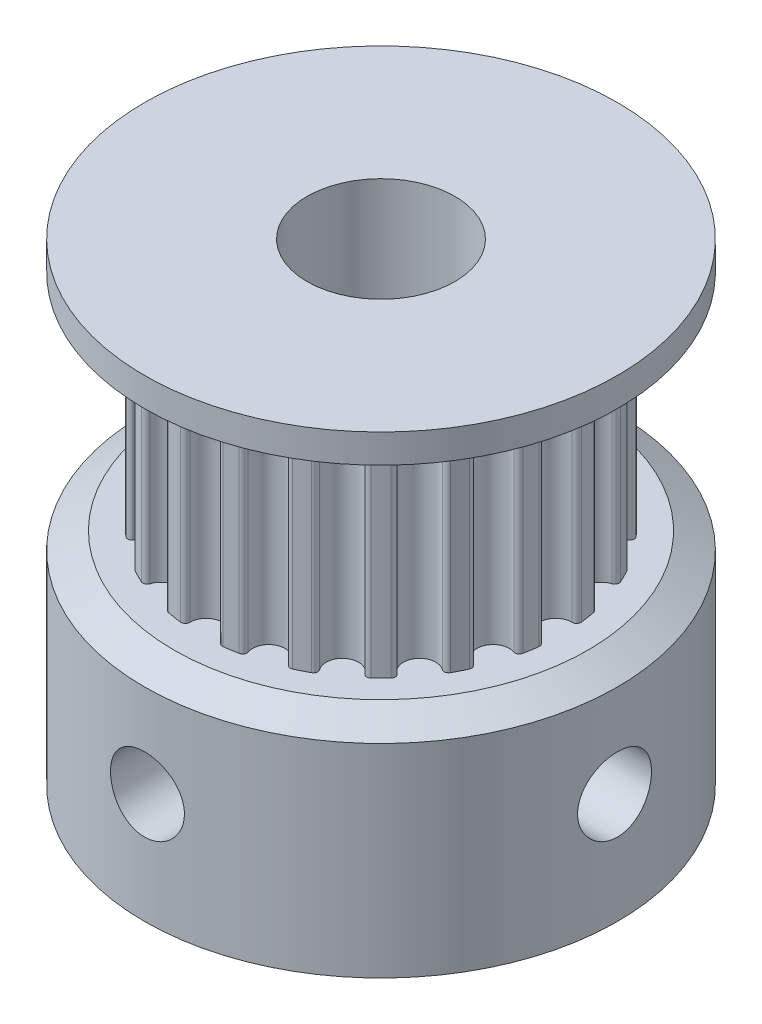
from build123d import *
from OCP.BRepFilletAPI import BRepFilletAPI_MakeChamfer

# Parameters (mm, degrees)
SKETCH_1_R               = 8
SKETCH_1_R_2             = 2.5
EXTRUDE_1_DEPTH          = 7.45
SKETCH_2_R               = 2.5
EXTRUDE_2_DEPTH          = 7
SKETCH_3_R               = 8
SKETCH_3_R_2             = 2.5
EXTRUDE_3_DEPTH          = 1.55
CUT_EXTRUDE_1_REACH      = 21.596
CUT_EXTRUDE_1_END_RADIUS = 8
SKETCH_4_R               = 1.25
CUT_EXTRUDE_2_REACH      = 21.596
CUT_EXTRUDE_2_END_RADIUS = 8
SKETCH_5_R               = 1.25
CHAMFER_1_SIZE           = 1
CHAMFER_1_SIZE2          = 0.577350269


with BuildPart() as part:
    # Sketch 1 → Extrude 1 (new body)
    with BuildSketch(Plane(origin=(0, 0, 0), x_dir=(1, 0, 0), z_dir=(0, 1, 0))):
        with Locations(Location((0, 0, 0), (0, 0, 270))):
            Circle(SKETCH_1_R)
        with Locations(Location((0, 0, 0), (0, 0, 270))):
            Circle(SKETCH_1_R_2, mode=Mode.SUBTRACT)
    extrude(amount=EXTRUDE_1_DEPTH)

    # Sketch 2 → Extrude 2 (add)
    with BuildSketch(Plane(origin=(0, 7.45, 0), x_dir=(1, 0, 0), z_dir=(0, 1, 0))):
        with BuildLine():
            ThreePointArc((-2.557469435, 5.549004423), (-2.773881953, 5.444049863), (-2.985996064, 5.3306592))
            ThreePointArc((-2.985996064, 5.3306592), (-3.059404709, 5.231014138), (-3.032930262, 5.110113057))
            ThreePointArc((-3.032930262, 5.110113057), (-3.150528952, 4.33633109), (-3.922779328, 4.463599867))
            ThreePointArc((-3.922779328, 4.463599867), (-4.029582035, 4.526139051), (-4.14703464, 4.487115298))
            ThreePointArc((-4.14703464, 4.487115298), (-4.320422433, 4.320422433), (-4.487115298, 4.14703464))
            ThreePointArc((-4.487115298, 4.14703464), (-4.526139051, 4.029582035), (-4.463599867, 3.922779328))
            ThreePointArc((-4.463599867, 3.922779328), (-4.33633109, 3.150528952), (-5.110113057, 3.032930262))
            ThreePointArc((-5.110113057, 3.032930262), (-5.231014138, 3.059404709), (-5.3306592, 2.985996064))
            ThreePointArc((-5.3306592, 2.985996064), (-5.444049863, 2.773881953), (-5.549004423, 2.557469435))
            ThreePointArc((-5.549004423, 2.557469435), (-5.549823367, 2.433706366), (-5.457341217, 2.351456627))
            ThreePointArc((-5.457341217, 2.351456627), (-5.097662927, 1.65633109), (-5.797233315, 1.305376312))
            ThreePointArc((-5.797233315, 1.305376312), (-5.92039813, 1.293194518), (-5.992481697, 1.19258673))
            ThreePointArc((-5.992481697, 1.19258673), (-6.034775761, 0.955814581), (-6.067718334, 0.717561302))
            ThreePointArc((-6.067718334, 0.717561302), (-6.030252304, 0.599602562), (-5.916879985, 0.549956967))
            ThreePointArc((-5.916879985, 0.549956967), (-5.36, 0), (-5.916879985, -0.549956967))
            ThreePointArc((-5.916879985, -0.549956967), (-6.030252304, -0.599602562), (-6.067718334, -0.717561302))
            ThreePointArc((-6.067718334, -0.717561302), (-6.034775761, -0.955814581), (-5.992481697, -1.19258673))
            ThreePointArc((-5.992481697, -1.19258673), (-5.92039813, -1.293194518), (-5.797233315, -1.305376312))
            ThreePointArc((-5.797233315, -1.305376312), (-5.097662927, -1.65633109), (-5.457341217, -2.351456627))
            ThreePointArc((-5.457341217, -2.351456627), (-5.549823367, -2.433706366), (-5.549004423, -2.557469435))
            ThreePointArc((-5.549004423, -2.557469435), (-5.444049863, -2.773881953), (-5.3306592, -2.985996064))
            ThreePointArc((-5.3306592, -2.985996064), (-5.231014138, -3.059404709), (-5.110113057, -3.032930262))
            ThreePointArc((-5.110113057, -3.032930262), (-4.33633109, -3.150528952), (-4.463599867, -3.922779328))
            ThreePointArc((-4.463599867, -3.922779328), (-4.526139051, -4.029582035), (-4.487115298, -4.14703464))
            ThreePointArc((-4.487115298, -4.14703464), (-4.320422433, -4.320422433), (-4.14703464, -4.487115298))
            ThreePointArc((-4.14703464, -4.487115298), (-4.029582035, -4.526139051), (-3.922779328, -4.463599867))
            ThreePointArc((-3.922779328, -4.463599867), (-3.150528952, -4.33633109), (-3.032930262, -5.110113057))
            ThreePointArc((-3.032930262, -5.110113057), (-3.059404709, -5.231014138), (-2.985996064, -5.3306592))
            ThreePointArc((-2.985996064, -5.3306592), (-2.773881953, -5.444049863), (-2.557469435, -5.549004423))
            ThreePointArc((-2.557469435, -5.549004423), (-2.433706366, -5.549823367), (-2.351456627, -5.457341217))
            ThreePointArc((-2.351456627, -5.457341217), (-1.65633109, -5.097662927), (-1.305376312, -5.797233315))
            ThreePointArc((-1.305376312, -5.797233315), (-1.293194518, -5.92039813), (-1.19258673, -5.992481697))
            ThreePointArc((-1.19258673, -5.992481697), (-0.955814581, -6.034775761), (-0.717561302, -6.067718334))
            ThreePointArc((-0.717561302, -6.067718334), (-0.599602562, -6.030252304), (-0.549956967, -5.916879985))
            ThreePointArc((-0.549956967, -5.916879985), (0, -5.36), (0.549956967, -5.916879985))
            ThreePointArc((0.549956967, -5.916879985), (0.599602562, -6.030252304), (0.717561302, -6.067718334))
            ThreePointArc((0.717561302, -6.067718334), (0.955814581, -6.034775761), (1.19258673, -5.992481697))
            ThreePointArc((1.19258673, -5.992481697), (1.293194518, -5.92039813), (1.305376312, -5.797233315))
            ThreePointArc((1.305376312, -5.797233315), (1.65633109, -5.097662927), (2.351456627, -5.457341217))
            ThreePointArc((2.351456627, -5.457341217), (2.433706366, -5.549823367), (2.557469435, -5.549004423))
            ThreePointArc((2.557469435, -5.549004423), (2.773881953, -5.444049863), (2.985996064, -5.3306592))
            ThreePointArc((2.985996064, -5.3306592), (3.059404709, -5.231014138), (3.032930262, -5.110113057))
            ThreePointArc((3.032930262, -5.110113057), (3.150528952, -4.33633109), (3.922779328, -4.463599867))
            ThreePointArc((3.922779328, -4.463599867), (4.029582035, -4.526139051), (4.14703464, -4.487115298))
            ThreePointArc((4.14703464, -4.487115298), (4.320422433, -4.320422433), (4.487115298, -4.14703464))
            ThreePointArc((4.487115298, -4.14703464), (4.526139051, -4.029582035), (4.463599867, -3.922779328))
            ThreePointArc((4.463599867, -3.922779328), (4.33633109, -3.150528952), (5.110113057, -3.032930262))
            ThreePointArc((5.110113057, -3.032930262), (5.231014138, -3.059404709), (5.3306592, -2.985996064))
            ThreePointArc((5.3306592, -2.985996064), (5.444049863, -2.773881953), (5.549004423, -2.557469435))
            ThreePointArc((5.549004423, -2.557469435), (5.549823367, -2.433706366), (5.457341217, -2.351456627))
            ThreePointArc((5.457341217, -2.351456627), (5.097662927, -1.65633109), (5.797233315, -1.305376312))
            ThreePointArc((5.797233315, -1.305376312), (5.92039813, -1.293194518), (5.992481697, -1.19258673))
            ThreePointArc((5.992481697, -1.19258673), (6.034775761, -0.955814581), (6.067718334, -0.717561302))
            ThreePointArc((6.067718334, -0.717561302), (6.030252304, -0.599602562), (5.916879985, -0.549956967))
            ThreePointArc((5.916879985, -0.549956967), (5.36, 0), (5.916879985, 0.549956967))
            ThreePointArc((5.916879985, 0.549956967), (6.030252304, 0.599602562), (6.067718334, 0.717561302))
            ThreePointArc((6.067718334, 0.717561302), (6.034775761, 0.955814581), (5.992481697, 1.19258673))
            ThreePointArc((5.992481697, 1.19258673), (5.92039813, 1.293194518), (5.797233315, 1.305376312))
            ThreePointArc((5.797233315, 1.305376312), (5.097662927, 1.65633109), (5.457341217, 2.351456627))
            ThreePointArc((5.457341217, 2.351456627), (5.549823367, 2.433706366), (5.549004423, 2.557469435))
            ThreePointArc((5.549004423, 2.557469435), (5.444049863, 2.773881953), (5.3306592, 2.985996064))
            ThreePointArc((5.3306592, 2.985996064), (5.231014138, 3.059404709), (5.110113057, 3.032930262))
            ThreePointArc((5.110113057, 3.032930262), (4.33633109, 3.150528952), (4.463599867, 3.922779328))
            ThreePointArc((4.463599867, 3.922779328), (4.526139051, 4.029582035), (4.487115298, 4.14703464))
            ThreePointArc((4.487115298, 4.14703464), (4.320422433, 4.320422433), (4.14703464, 4.487115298))
            ThreePointArc((4.14703464, 4.487115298), (4.029582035, 4.526139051), (3.922779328, 4.463599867))
            ThreePointArc((3.922779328, 4.463599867), (3.150528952, 4.33633109), (3.032930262, 5.110113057))
            ThreePointArc((3.032930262, 5.110113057), (3.059404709, 5.231014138), (2.985996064, 5.3306592))
            ThreePointArc((2.985996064, 5.3306592), (2.773881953, 5.444049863), (2.557469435, 5.549004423))
            ThreePointArc((2.557469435, 5.549004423), (2.433706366, 5.549823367), (2.351456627, 5.457341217))
            ThreePointArc((2.351456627, 5.457341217), (1.65633109, 5.097662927), (1.305376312, 5.797233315))
            ThreePointArc((1.305376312, 5.797233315), (1.293194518, 5.92039813), (1.19258673, 5.992481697))
            ThreePointArc((1.19258673, 5.992481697), (0.955814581, 6.034775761), (0.717561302, 6.067718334))
            ThreePointArc((0.717561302, 6.067718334), (0.599602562, 6.030252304), (0.549956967, 5.916879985))
            ThreePointArc((0.549956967, 5.916879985), (0, 5.36), (-0.549956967, 5.916879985))
            ThreePointArc((-0.549956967, 5.916879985), (-0.599602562, 6.030252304), (-0.717561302, 6.067718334))
            ThreePointArc((-0.717561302, 6.067718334), (-0.955814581, 6.034775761), (-1.19258673, 5.992481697))
            ThreePointArc((-1.19258673, 5.992481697), (-1.293194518, 5.92039813), (-1.305376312, 5.797233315))
            ThreePointArc((-1.305376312, 5.797233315), (-1.65633109, 5.097662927), (-2.351456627, 5.457341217))
            ThreePointArc((-2.351456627, 5.457341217), (-2.433706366, 5.549823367), (-2.557469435, 5.549004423))
        make_face()
        with Locations(Location((0, 0, 0), (0, 0, 270))):
            Circle(SKETCH_2_R, mode=Mode.SUBTRACT)
    extrude(amount=EXTRUDE_2_DEPTH)

    # Sketch 3 → Extrude 3 (add)
    with BuildSketch(Plane(origin=(0, 14.45, 0), x_dir=(1, 0, 0), z_dir=(0, 1, 0))):
        with Locations(Location((0, 0, 0), (0, 0, 270))):
            Circle(SKETCH_3_R)
        with Locations(Location((0, 0, 0), (0, 0, 270))):
            Circle(SKETCH_3_R_2, mode=Mode.SUBTRACT)
    extrude(amount=EXTRUDE_3_DEPTH)

    # Cut-Extrude 1: up to this cylinder (the profile starts inside it)
    cut_extrude_1_end = Plane(origin=(0, 3.725, 0), z_dir=(0, -1, 0)) * Cylinder(CUT_EXTRUDE_1_END_RADIUS, 60.192, mode=Mode.PRIVATE)
    # Sketch 4 → Cut-Extrude 1 (cut, up to the surface)
    with BuildSketch(Plane.XY, mode=Mode.PRIVATE) as cut_extrude_1_sk1:
        with Locations(Location((0, 3.725, 0), (0, 0, 180))):
            Circle(SKETCH_4_R)
    cut_extrude_1_tool1 = extrude(cut_extrude_1_sk1.sketch, amount=CUT_EXTRUDE_1_REACH, mode=Mode.PRIVATE) & cut_extrude_1_end
    add(cut_extrude_1_tool1.solids().sort_by_distance((0, 3.725, 0))[0], mode=Mode.SUBTRACT)

    # Cut-Extrude 2: up to this cylinder (the profile starts inside it)
    cut_extrude_2_end = Plane(origin=(0, 3.725, 0), z_dir=(0, -1, 0)) * Cylinder(CUT_EXTRUDE_2_END_RADIUS, 60.192, mode=Mode.PRIVATE)
    # Sketch 5 → Cut-Extrude 2 (cut, up to the surface)
    with BuildSketch(Plane(origin=(0, 0, 0), x_dir=(0, 0, -1), z_dir=(1, 0, 0)), mode=Mode.PRIVATE) as cut_extrude_2_sk1:
        with Locations(Location((0, 3.725, 0), (0, 0, 180))):
            Circle(SKETCH_5_R)
    cut_extrude_2_tool1 = extrude(cut_extrude_2_sk1.sketch, amount=CUT_EXTRUDE_2_REACH, mode=Mode.PRIVATE) & cut_extrude_2_end
    add(cut_extrude_2_tool1.solids().sort_by_distance((0, 3.725, 0))[0], mode=Mode.SUBTRACT)

    # Chamfer 1: one chamfer whose edges measure the first distance from different faces: ONE call of the kernel's chamfer builder (chamfer() names one face for all edges)
    chamfer_1_edges_1 = [part.edges().sort_by_distance(p)[0] for p in [
        (0, 14.45, -8),
    ]]
    chamfer_1_side_1 = [part.faces().sort_by_distance(p)[0] for p in [
        (0, 14.45, -7.77372583),
    ]]
    chamfer_1_edges_2 = [part.edges().sort_by_distance(p)[0] for p in [
        (0, 7.45, -8),
    ]]
    chamfer_1_side_2 = [part.faces().sort_by_distance(p)[0] for p in [
        (0, 7.45, -7.77372583),
    ]]
    chamfer_1 = BRepFilletAPI_MakeChamfer(part.part.solid().wrapped)
    for e in chamfer_1_edges_1:
        chamfer_1.Add(CHAMFER_1_SIZE, CHAMFER_1_SIZE2, e.wrapped, chamfer_1_side_1[0].wrapped)  # the first distance lies on this face
    for e in chamfer_1_edges_2:
        chamfer_1.Add(CHAMFER_1_SIZE, CHAMFER_1_SIZE2, e.wrapped, chamfer_1_side_2[0].wrapped)  # the first distance lies on this face
    add(Compound.cast(chamfer_1.Shape()), mode=Mode.REPLACE)


solid = part.part
